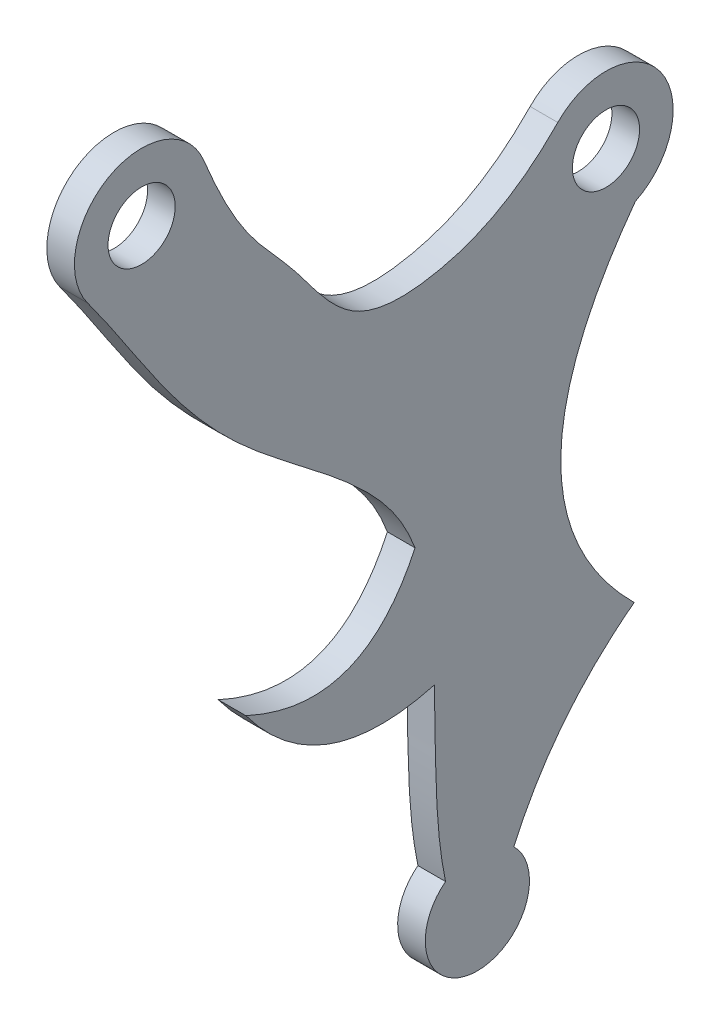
ISO-10303-21;
HEADER;
FILE_DESCRIPTION(('STEP AP214'),'2;1');
FILE_NAME('part.step','',(''),(''),'','','');
FILE_SCHEMA(('AUTOMOTIVE_DESIGN { 1 0 10303 214 1 1 1 1 }'));
ENDSEC;
DATA;
#1=APPLICATION_CONTEXT('core data for automotive mechanical design processes');
#2=APPLICATION_PROTOCOL_DEFINITION('international standard','automotive_design',2000,#1);
#3=PRODUCT_CONTEXT('',#1,'mechanical');
#4=PRODUCT('Part','Part','',(#3));
#5=PRODUCT_RELATED_PRODUCT_CATEGORY('part','',(#4));
#6=PRODUCT_DEFINITION_FORMATION('','',#4);
#7=PRODUCT_DEFINITION_CONTEXT('part definition',#1,'design');
#8=PRODUCT_DEFINITION('design','',#6,#7);
#9=PRODUCT_DEFINITION_SHAPE('','',#8);
#10=(LENGTH_UNIT() NAMED_UNIT(*) SI_UNIT(.MILLI.,.METRE.));
#11=(NAMED_UNIT(*) PLANE_ANGLE_UNIT() SI_UNIT($,.RADIAN.));
#12=(NAMED_UNIT(*) SI_UNIT($,.STERADIAN.) SOLID_ANGLE_UNIT());
#13=UNCERTAINTY_MEASURE_WITH_UNIT(LENGTH_MEASURE(1.E-05),#10,'distance_accuracy_value','');
#14=(GEOMETRIC_REPRESENTATION_CONTEXT(3) GLOBAL_UNCERTAINTY_ASSIGNED_CONTEXT((#13)) GLOBAL_UNIT_ASSIGNED_CONTEXT((#10,
#11,#12)) REPRESENTATION_CONTEXT('',''));
#15=CARTESIAN_POINT('',(0.,0.,0.));
#16=DIRECTION('',(0.,0.,1.));
#17=DIRECTION('',(1.,0.,0.));
#18=AXIS2_PLACEMENT_3D('',#15,#16,#17);
#19=CARTESIAN_POINT('',(7.37498578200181,-25.0102253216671,20.6861108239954));
#20=CARTESIAN_POINT('',(7.37498578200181,-29.779202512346,25.3133521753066));
#21=CARTESIAN_POINT('',(7.37498578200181,-33.2226011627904,33.226693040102));
#22=CARTESIAN_POINT('',(7.37498578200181,-33.059394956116,43.4810934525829));
#23=CARTESIAN_POINT('',(7.37498578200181,-20.8757063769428,51.4021485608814));
#24=CARTESIAN_POINT('',(7.37498578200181,-19.583144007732,54.91802754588));
#25=CARTESIAN_POINT('',(7.37498578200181,-9.35277054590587,59.1267170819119));
#26=B_SPLINE_CURVE_WITH_KNOTS('',3,(#19,#20,#21,#22,#23,#24,#25),.UNSPECIFIED.,.F.,.F.,(4,1,1,1,
4),(0.,0.244231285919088,0.417100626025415,0.60574582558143,1.),.UNSPECIFIED.);
#27=DIRECTION('',(1.,0.,0.));
#28=VECTOR('',#27,1.);
#29=SURFACE_OF_LINEAR_EXTRUSION('',#26,#28);
#30=DIRECTION('',(1.,0.,0.));
#31=VECTOR('',#30,1.);
#32=CARTESIAN_POINT('',(7.37498578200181,-25.0102253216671,20.6861108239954));
#33=LINE('',#32,#31);
#34=CARTESIAN_POINT('',(4.37498578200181,-25.0102253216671,20.6861108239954));
#35=VERTEX_POINT('',#34);
#36=CARTESIAN_POINT('',(7.37498578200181,-25.0102253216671,20.6861108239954));
#37=VERTEX_POINT('',#36);
#38=EDGE_CURVE('E11',#35,#37,#33,.T.);
#39=ORIENTED_EDGE('',*,*,#38,.F.);
#40=CARTESIAN_POINT('',(4.37498578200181,-25.0102253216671,20.6861108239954));
#41=CARTESIAN_POINT('',(4.37498578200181,-29.779202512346,25.3133521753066));
#42=CARTESIAN_POINT('',(4.37498578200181,-33.2226011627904,33.226693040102));
#43=CARTESIAN_POINT('',(4.37498578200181,-33.059394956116,43.4810934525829));
#44=CARTESIAN_POINT('',(4.37498578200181,-20.8757063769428,51.4021485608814));
#45=CARTESIAN_POINT('',(4.37498578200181,-19.583144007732,54.91802754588));
#46=CARTESIAN_POINT('',(4.37498578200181,-9.35277054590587,59.1267170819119));
#47=B_SPLINE_CURVE_WITH_KNOTS('',3,(#40,#41,#42,#43,#44,#45,#46),.UNSPECIFIED.,.F.,.F.,(4,1,1,1,
4),(0.,0.244231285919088,0.417100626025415,0.60574582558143,1.),.UNSPECIFIED.);
#48=CARTESIAN_POINT('',(4.37498578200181,-9.35277054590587,59.1267170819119));
#49=VERTEX_POINT('',#48);
#50=EDGE_CURVE('E216',#35,#49,#47,.T.);
#51=ORIENTED_EDGE('',*,*,#50,.T.);
#52=DIRECTION('',(1.,0.,0.));
#53=VECTOR('',#52,1.);
#54=CARTESIAN_POINT('',(7.37498578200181,-9.35277054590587,59.1267170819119));
#55=LINE('',#54,#53);
#56=CARTESIAN_POINT('',(7.37498578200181,-9.35277054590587,59.1267170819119));
#57=VERTEX_POINT('',#56);
#58=EDGE_CURVE('E51',#49,#57,#55,.T.);
#59=ORIENTED_EDGE('',*,*,#58,.T.);
#60=EDGE_CURVE('E183',#37,#57,#26,.T.);
#61=ORIENTED_EDGE('',*,*,#60,.F.);
#62=EDGE_LOOP('',(#39,#51,#59,#61));
#63=FACE_BOUND('',#62,.T.);
#64=ADVANCED_FACE('F42',(#63),#29,.T.);
#65=CARTESIAN_POINT('',(7.37498578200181,-12.1269197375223,65.8700470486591));
#66=DIRECTION('',(1.,0.,0.));
#67=DIRECTION('',(0.,0.,-1.));
#68=AXIS2_PLACEMENT_3D('',#65,#66,#67);
#69=CYLINDRICAL_SURFACE('',#68,7.29166666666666);
#70=ORIENTED_EDGE('',*,*,#58,.F.);
#71=CARTESIAN_POINT('',(4.37498578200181,-12.1269197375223,65.8700470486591));
#72=DIRECTION('',(1.,0.,0.));
#73=DIRECTION('',(0.,0.,-1.));
#74=AXIS2_PLACEMENT_3D('',#71,#72,#73);
#75=CIRCLE('',#74,7.29166666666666);
#76=CARTESIAN_POINT('',(4.37498578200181,-16.4526187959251,71.7400326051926));
#77=VERTEX_POINT('',#76);
#78=EDGE_CURVE('E219',#49,#77,#75,.T.);
#79=ORIENTED_EDGE('',*,*,#78,.T.);
#80=DIRECTION('',(1.,0.,0.));
#81=VECTOR('',#80,1.);
#82=CARTESIAN_POINT('',(7.37498578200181,-16.4526187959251,71.7400326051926));
#83=LINE('',#82,#81);
#84=CARTESIAN_POINT('',(7.37498578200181,-16.4526187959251,71.7400326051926));
#85=VERTEX_POINT('',#84);
#86=EDGE_CURVE('E207',#77,#85,#83,.T.);
#87=ORIENTED_EDGE('',*,*,#86,.T.);
#88=CARTESIAN_POINT('',(7.37498578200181,-12.1269197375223,65.8700470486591));
#89=DIRECTION('',(1.,0.,0.));
#90=DIRECTION('',(0.,0.,-1.));
#91=AXIS2_PLACEMENT_3D('',#88,#89,#90);
#92=CIRCLE('',#91,7.29166666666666);
#93=EDGE_CURVE('E190',#57,#85,#92,.T.);
#94=ORIENTED_EDGE('',*,*,#93,.F.);
#95=EDGE_LOOP('',(#70,#79,#87,#94));
#96=FACE_BOUND('',#95,.T.);
#97=ADVANCED_FACE('F174',(#96),#69,.T.);
#98=CARTESIAN_POINT('',(7.37498578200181,-16.4526187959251,71.7400326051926));
#99=CARTESIAN_POINT('',(7.37498578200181,-21.1908708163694,68.2483285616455));
#100=CARTESIAN_POINT('',(7.37498578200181,-29.0200369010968,63.6693040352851));
#101=CARTESIAN_POINT('',(7.37498578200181,-41.6337917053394,52.378888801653));
#102=CARTESIAN_POINT('',(7.37498578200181,-56.4648831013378,26.1681263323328));
#103=CARTESIAN_POINT('',(7.37498578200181,-87.4389157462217,38.3842110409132));
#104=CARTESIAN_POINT('',(7.37498578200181,-100.346883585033,28.4899302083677));
#105=B_SPLINE_CURVE_WITH_KNOTS('',3,(#98,#99,#100,#101,#102,#103,#104),.UNSPECIFIED.,.F.,.F.,(4,
1,1,1,4),(0.,0.172902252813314,0.282713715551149,0.516825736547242,1.),.UNSPECIFIED.);
#106=DIRECTION('',(1.,0.,0.));
#107=VECTOR('',#106,1.);
#108=SURFACE_OF_LINEAR_EXTRUSION('',#105,#107);
#109=ORIENTED_EDGE('',*,*,#86,.F.);
#110=CARTESIAN_POINT('',(4.37498578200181,-16.4526187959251,71.7400326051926));
#111=CARTESIAN_POINT('',(4.37498578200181,-21.1908708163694,68.2483285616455));
#112=CARTESIAN_POINT('',(4.37498578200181,-29.0200369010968,63.6693040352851));
#113=CARTESIAN_POINT('',(4.37498578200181,-41.6337917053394,52.378888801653));
#114=CARTESIAN_POINT('',(4.37498578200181,-56.4648831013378,26.1681263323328));
#115=CARTESIAN_POINT('',(4.37498578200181,-87.4389157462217,38.3842110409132));
#116=CARTESIAN_POINT('',(4.37498578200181,-100.346883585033,28.4899302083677));
#117=B_SPLINE_CURVE_WITH_KNOTS('',3,(#110,#111,#112,#113,#114,#115,#116),.UNSPECIFIED.,.F.,.F.,
(4,1,1,1,4),(0.,0.172902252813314,0.282713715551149,0.516825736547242,1.),.UNSPECIFIED.);
#118=CARTESIAN_POINT('',(4.37498578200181,-57.2539751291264,36.1864414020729));
#119=VERTEX_POINT('',#118);
#120=EDGE_CURVE('E209',#77,#119,#117,.T.);
#121=ORIENTED_EDGE('',*,*,#120,.T.);
#122=DIRECTION('',(1.,0.,0.));
#123=VECTOR('',#122,1.);
#124=CARTESIAN_POINT('',(7.37498578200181,-57.2539751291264,36.1864414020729));
#125=LINE('',#124,#123);
#126=CARTESIAN_POINT('',(7.37498578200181,-57.2539751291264,36.1864414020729));
#127=VERTEX_POINT('',#126);
#128=EDGE_CURVE('E134',#119,#127,#125,.T.);
#129=ORIENTED_EDGE('',*,*,#128,.T.);
#130=EDGE_CURVE('E145',#85,#127,#105,.T.);
#131=ORIENTED_EDGE('',*,*,#130,.F.);
#132=EDGE_LOOP('',(#109,#121,#129,#131));
#133=FACE_BOUND('',#132,.T.);
#134=ADVANCED_FACE('F173',(#133),#108,.T.);
#135=CARTESIAN_POINT('',(7.37498578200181,-63.8554620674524,54.5522225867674));
#136=CARTESIAN_POINT('',(7.37498578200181,-69.653599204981,41.9772947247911));
#137=CARTESIAN_POINT('',(7.37498578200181,-57.2539751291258,36.1864414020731));
#138=B_SPLINE_CURVE_WITH_KNOTS('',2,(#135,#136,#137),.UNSPECIFIED.,.F.,.F.,(3,3),(0.,1.),.UNSPECIFIED.);
#139=DIRECTION('',(1.,0.,0.));
#140=VECTOR('',#139,1.);
#141=SURFACE_OF_LINEAR_EXTRUSION('',#138,#140);
#142=ORIENTED_EDGE('',*,*,#128,.F.);
#143=CARTESIAN_POINT('',(4.37498578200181,-63.8554620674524,54.5522225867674));
#144=CARTESIAN_POINT('',(4.37498578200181,-69.653599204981,41.9772947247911));
#145=CARTESIAN_POINT('',(4.37498578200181,-57.2539751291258,36.1864414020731));
#146=B_SPLINE_CURVE_WITH_KNOTS('',2,(#143,#144,#145),.UNSPECIFIED.,.F.,.F.,(3,3),(0.,1.),.UNSPECIFIED.);
#147=CARTESIAN_POINT('',(4.37498578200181,-63.8554620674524,54.5522225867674));
#148=VERTEX_POINT('',#147);
#149=EDGE_CURVE('E129',#148,#119,#146,.T.);
#150=ORIENTED_EDGE('',*,*,#149,.F.);
#151=DIRECTION('',(1.,0.,0.));
#152=VECTOR('',#151,1.);
#153=CARTESIAN_POINT('',(7.37498578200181,-63.8554620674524,54.5522225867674));
#154=LINE('',#153,#152);
#155=CARTESIAN_POINT('',(7.37498578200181,-63.8554620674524,54.5522225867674));
#156=VERTEX_POINT('',#155);
#157=EDGE_CURVE('E124',#148,#156,#154,.T.);
#158=ORIENTED_EDGE('',*,*,#157,.T.);
#159=EDGE_CURVE('E127',#156,#127,#138,.T.);
#160=ORIENTED_EDGE('',*,*,#159,.T.);
#161=EDGE_LOOP('',(#142,#150,#158,#160));
#162=FACE_BOUND('',#161,.T.);
#163=ADVANCED_FACE('F126',(#162),#141,.F.);
#164=CARTESIAN_POINT('',(7.37498578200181,-71.1997140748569,34.0869295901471));
#165=CARTESIAN_POINT('',(7.37498578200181,-74.5968468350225,46.5739223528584));
#166=CARTESIAN_POINT('',(7.37498578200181,-63.8554620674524,54.5522225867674));
#167=B_SPLINE_CURVE_WITH_KNOTS('',2,(#164,#165,#166),.UNSPECIFIED.,.F.,.F.,(3,3),(0.,1.),.UNSPECIFIED.);
#168=DIRECTION('',(1.,0.,0.));
#169=VECTOR('',#168,1.);
#170=SURFACE_OF_LINEAR_EXTRUSION('',#167,#169);
#171=ORIENTED_EDGE('',*,*,#157,.F.);
#172=CARTESIAN_POINT('',(4.37498578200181,-71.1997140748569,34.0869295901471));
#173=CARTESIAN_POINT('',(4.37498578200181,-74.5968468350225,46.5739223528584));
#174=CARTESIAN_POINT('',(4.37498578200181,-63.8554620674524,54.5522225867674));
#175=B_SPLINE_CURVE_WITH_KNOTS('',2,(#172,#173,#174),.UNSPECIFIED.,.F.,.F.,(3,3),(0.,1.),.UNSPECIFIED.);
#176=CARTESIAN_POINT('',(4.37498578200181,-71.1997140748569,34.0869295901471));
#177=VERTEX_POINT('',#176);
#178=EDGE_CURVE('E279',#177,#148,#175,.T.);
#179=ORIENTED_EDGE('',*,*,#178,.F.);
#180=DIRECTION('',(1.,0.,0.));
#181=VECTOR('',#180,1.);
#182=CARTESIAN_POINT('',(7.37498578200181,-71.1997140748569,34.0869295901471));
#183=LINE('',#182,#181);
#184=CARTESIAN_POINT('',(7.37498578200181,-71.1997140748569,34.0869295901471));
#185=VERTEX_POINT('',#184);
#186=EDGE_CURVE('E135',#177,#185,#183,.T.);
#187=ORIENTED_EDGE('',*,*,#186,.T.);
#188=EDGE_CURVE('E141',#185,#156,#167,.T.);
#189=ORIENTED_EDGE('',*,*,#188,.T.);
#190=EDGE_LOOP('',(#171,#179,#187,#189));
#191=FACE_BOUND('',#190,.T.);
#192=ADVANCED_FACE('F147',(#191),#170,.F.);
#193=DIRECTION('',(1.,0.,0.));
#194=VECTOR('',#193,1.);
#195=CARTESIAN_POINT('',(7.37498578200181,-90.2904727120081,32.8721041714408));
#196=LINE('',#195,#194);
#197=CARTESIAN_POINT('',(7.37498578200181,-90.2904727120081,32.8721041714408));
#198=VERTEX_POINT('',#197);
#199=CARTESIAN_POINT('',(4.37498578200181,-90.2904727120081,32.8721041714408));
#200=VERTEX_POINT('',#199);
#201=EDGE_CURVE('E264',#198,#200,#196,.F.);
#202=ORIENTED_EDGE('',*,*,#201,.F.);
#203=EDGE_CURVE('E148',#185,#198,#105,.T.);
#204=ORIENTED_EDGE('',*,*,#203,.F.);
#205=ORIENTED_EDGE('',*,*,#186,.F.);
#206=CARTESIAN_POINT('',(4.37498578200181,-16.4526187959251,71.7400326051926));
#207=CARTESIAN_POINT('',(4.37498578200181,-21.1908708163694,68.2483285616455));
#208=CARTESIAN_POINT('',(4.37498578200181,-29.0200369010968,63.6693040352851));
#209=CARTESIAN_POINT('',(4.37498578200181,-41.6337917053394,52.378888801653));
#210=CARTESIAN_POINT('',(4.37498578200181,-56.4648831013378,26.1681263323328));
#211=CARTESIAN_POINT('',(4.37498578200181,-87.4389157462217,38.3842110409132));
#212=CARTESIAN_POINT('',(4.37498578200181,-100.346883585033,28.4899302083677));
#213=B_SPLINE_CURVE_WITH_KNOTS('',3,(#206,#207,#208,#209,#210,#211,#212),.UNSPECIFIED.,.F.,.F.,
(4,1,1,1,4),(0.,0.172902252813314,0.282713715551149,0.516825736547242,1.),.UNSPECIFIED.);
#214=EDGE_CURVE('E271',#177,#200,#213,.T.);
#215=ORIENTED_EDGE('',*,*,#214,.T.);
#216=EDGE_LOOP('',(#202,#204,#205,#215));
#217=FACE_BOUND('',#216,.T.);
#218=ADVANCED_FACE('F169',(#217),#108,.T.);
#219=CARTESIAN_POINT('',(7.37498578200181,-100.346883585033,28.4899302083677));
#220=CARTESIAN_POINT('',(7.37498578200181,-83.9088981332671,25.0862169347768));
#221=CARTESIAN_POINT('',(7.37498578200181,-74.2909084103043,12.3938322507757));
#222=B_SPLINE_CURVE_WITH_KNOTS('',2,(#219,#220,#221),.UNSPECIFIED.,.F.,.F.,(3,3),(0.,1.),.UNSPECIFIED.);
#223=DIRECTION('',(1.,0.,0.));
#224=VECTOR('',#223,1.);
#225=SURFACE_OF_LINEAR_EXTRUSION('',#222,#224);
#226=DIRECTION('',(1.,0.,0.));
#227=VECTOR('',#226,1.);
#228=CARTESIAN_POINT('',(7.37498578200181,-90.7325032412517,25.4525785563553));
#229=LINE('',#228,#227);
#230=CARTESIAN_POINT('',(4.37498578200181,-90.7325032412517,25.4525785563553));
#231=VERTEX_POINT('',#230);
#232=CARTESIAN_POINT('',(7.37498578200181,-90.7325032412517,25.4525785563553));
#233=VERTEX_POINT('',#232);
#234=EDGE_CURVE('E298',#231,#233,#229,.T.);
#235=ORIENTED_EDGE('',*,*,#234,.F.);
#236=CARTESIAN_POINT('',(4.37498578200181,-100.346883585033,28.4899302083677));
#237=CARTESIAN_POINT('',(4.37498578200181,-83.9088981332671,25.0862169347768));
#238=CARTESIAN_POINT('',(4.37498578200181,-74.2909084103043,12.3938322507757));
#239=B_SPLINE_CURVE_WITH_KNOTS('',2,(#236,#237,#238),.UNSPECIFIED.,.F.,.F.,(3,3),(0.,1.),.UNSPECIFIED.);
#240=CARTESIAN_POINT('',(4.37498578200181,-74.2909084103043,12.3938322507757));
#241=VERTEX_POINT('',#240);
#242=EDGE_CURVE('E243',#231,#241,#239,.T.);
#243=ORIENTED_EDGE('',*,*,#242,.T.);
#244=DIRECTION('',(1.,0.,0.));
#245=VECTOR('',#244,1.);
#246=CARTESIAN_POINT('',(7.37498578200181,-74.2909084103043,12.3938322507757));
#247=LINE('',#246,#245);
#248=CARTESIAN_POINT('',(7.37498578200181,-74.2909084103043,12.3938322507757));
#249=VERTEX_POINT('',#248);
#250=EDGE_CURVE('E247',#241,#249,#247,.T.);
#251=ORIENTED_EDGE('',*,*,#250,.T.);
#252=EDGE_CURVE('E64',#233,#249,#222,.T.);
#253=ORIENTED_EDGE('',*,*,#252,.F.);
#254=EDGE_LOOP('',(#235,#243,#251,#253));
#255=FACE_BOUND('',#254,.T.);
#256=ADVANCED_FACE('F312',(#255),#225,.T.);
#257=CARTESIAN_POINT('',(7.37498578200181,-74.2909084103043,12.3938322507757));
#258=CARTESIAN_POINT('',(7.37498578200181,-58.4363439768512,28.3906640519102));
#259=CARTESIAN_POINT('',(7.37498578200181,-36.64763410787,12.2689587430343));
#260=B_SPLINE_CURVE_WITH_KNOTS('',2,(#257,#258,#259),.UNSPECIFIED.,.F.,.F.,(3,3),(0.,1.),.UNSPECIFIED.);
#261=DIRECTION('',(1.,0.,0.));
#262=VECTOR('',#261,1.);
#263=SURFACE_OF_LINEAR_EXTRUSION('',#260,#262);
#264=ORIENTED_EDGE('',*,*,#250,.F.);
#265=CARTESIAN_POINT('',(4.37498578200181,-74.2909084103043,12.3938322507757));
#266=CARTESIAN_POINT('',(4.37498578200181,-58.4363439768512,28.3906640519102));
#267=CARTESIAN_POINT('',(4.37498578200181,-36.64763410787,12.2689587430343));
#268=B_SPLINE_CURVE_WITH_KNOTS('',2,(#265,#266,#267),.UNSPECIFIED.,.F.,.F.,(3,3),(0.,1.),.UNSPECIFIED.);
#269=CARTESIAN_POINT('',(4.37498578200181,-36.64763410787,12.2689587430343));
#270=VERTEX_POINT('',#269);
#271=EDGE_CURVE('E238',#241,#270,#268,.T.);
#272=ORIENTED_EDGE('',*,*,#271,.T.);
#273=DIRECTION('',(1.,0.,0.));
#274=VECTOR('',#273,1.);
#275=CARTESIAN_POINT('',(7.37498578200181,-36.64763410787,12.2689587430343));
#276=LINE('',#275,#274);
#277=CARTESIAN_POINT('',(7.37498578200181,-36.64763410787,12.2689587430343));
#278=VERTEX_POINT('',#277);
#279=EDGE_CURVE('E46',#270,#278,#276,.T.);
#280=ORIENTED_EDGE('',*,*,#279,.T.);
#281=EDGE_CURVE('E246',#249,#278,#260,.T.);
#282=ORIENTED_EDGE('',*,*,#281,.F.);
#283=EDGE_LOOP('',(#264,#272,#280,#282));
#284=FACE_BOUND('',#283,.T.);
#285=ADVANCED_FACE('F309',(#284),#263,.T.);
#286=CARTESIAN_POINT('',(7.37498578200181,-30.0878599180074,15.4529445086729));
#287=DIRECTION('',(1.,0.,0.));
#288=DIRECTION('',(0.,0.,-1.));
#289=AXIS2_PLACEMENT_3D('',#286,#287,#288);
#290=CYLINDRICAL_SURFACE('',#289,7.29166666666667);
#291=CARTESIAN_POINT('',(4.37498578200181,-30.0878599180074,15.4529445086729));
#292=DIRECTION('',(1.,0.,0.));
#293=DIRECTION('',(0.,0.,-1.));
#294=AXIS2_PLACEMENT_3D('',#291,#292,#293);
#295=CIRCLE('',#294,7.29166666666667);
#296=EDGE_CURVE('E226',#270,#35,#295,.T.);
#297=ORIENTED_EDGE('',*,*,#296,.T.);
#298=ORIENTED_EDGE('',*,*,#38,.T.);
#299=CARTESIAN_POINT('',(7.37498578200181,-30.0878599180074,15.4529445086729));
#300=DIRECTION('',(1.,0.,0.));
#301=DIRECTION('',(0.,0.,-1.));
#302=AXIS2_PLACEMENT_3D('',#299,#300,#301);
#303=CIRCLE('',#302,7.29166666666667);
#304=EDGE_CURVE('E191',#278,#37,#303,.T.);
#305=ORIENTED_EDGE('',*,*,#304,.F.);
#306=ORIENTED_EDGE('',*,*,#279,.F.);
#307=EDGE_LOOP('',(#297,#298,#305,#306));
#308=FACE_BOUND('',#307,.T.);
#309=ADVANCED_FACE('F182',(#308),#290,.T.);
#310=CARTESIAN_POINT('',(7.37498578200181,-12.1269197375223,65.8700470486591));
#311=DIRECTION('',(1.,0.,0.));
#312=DIRECTION('',(0.,0.,-1.));
#313=AXIS2_PLACEMENT_3D('',#310,#311,#312);
#314=CYLINDRICAL_SURFACE('',#313,3.64583333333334);
#315=CARTESIAN_POINT('',(7.37498578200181,-12.1269197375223,65.8700470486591));
#316=DIRECTION('',(1.,0.,0.));
#317=DIRECTION('',(0.,0.,-1.));
#318=AXIS2_PLACEMENT_3D('',#315,#316,#317);
#319=CIRCLE('',#318,3.64583333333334);
#320=CARTESIAN_POINT('',(7.37498578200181,-12.1269197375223,62.2242137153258));
#321=VERTEX_POINT('',#320);
#322=EDGE_CURVE('E255',#321,#321,#319,.T.);
#323=ORIENTED_EDGE('',*,*,#322,.T.);
#324=EDGE_LOOP('',(#323));
#325=FACE_BOUND('',#324,.T.);
#326=CARTESIAN_POINT('',(4.37498578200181,-12.1269197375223,65.8700470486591));
#327=DIRECTION('',(1.,0.,0.));
#328=DIRECTION('',(0.,0.,-1.));
#329=AXIS2_PLACEMENT_3D('',#326,#327,#328);
#330=CIRCLE('',#329,3.64583333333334);
#331=CARTESIAN_POINT('',(4.37498578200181,-12.1269197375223,62.2242137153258));
#332=VERTEX_POINT('',#331);
#333=EDGE_CURVE('E239',#332,#332,#330,.T.);
#334=ORIENTED_EDGE('',*,*,#333,.F.);
#335=EDGE_LOOP('',(#334));
#336=FACE_BOUND('',#335,.T.);
#337=ADVANCED_FACE('F321',(#325,#336),#314,.F.);
#338=CARTESIAN_POINT('',(7.37498578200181,-30.0878599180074,15.4529445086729));
#339=DIRECTION('',(1.,0.,0.));
#340=DIRECTION('',(0.,0.,-1.));
#341=AXIS2_PLACEMENT_3D('',#338,#339,#340);
#342=CYLINDRICAL_SURFACE('',#341,3.64583333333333);
#343=CARTESIAN_POINT('',(7.37498578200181,-30.0878599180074,15.4529445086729));
#344=DIRECTION('',(1.,0.,0.));
#345=DIRECTION('',(0.,0.,-1.));
#346=AXIS2_PLACEMENT_3D('',#343,#344,#345);
#347=CIRCLE('',#346,3.64583333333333);
#348=CARTESIAN_POINT('',(7.37498578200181,-30.0878599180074,11.8071111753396));
#349=VERTEX_POINT('',#348);
#350=EDGE_CURVE('E251',#349,#349,#347,.T.);
#351=ORIENTED_EDGE('',*,*,#350,.T.);
#352=EDGE_LOOP('',(#351));
#353=FACE_BOUND('',#352,.T.);
#354=CARTESIAN_POINT('',(4.37498578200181,-30.0878599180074,15.4529445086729));
#355=DIRECTION('',(1.,0.,0.));
#356=DIRECTION('',(0.,0.,-1.));
#357=AXIS2_PLACEMENT_3D('',#354,#355,#356);
#358=CIRCLE('',#357,3.64583333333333);
#359=CARTESIAN_POINT('',(4.37498578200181,-30.0878599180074,11.8071111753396));
#360=VERTEX_POINT('',#359);
#361=EDGE_CURVE('E242',#360,#360,#358,.T.);
#362=ORIENTED_EDGE('',*,*,#361,.F.);
#363=EDGE_LOOP('',(#362));
#364=FACE_BOUND('',#363,.T.);
#365=ADVANCED_FACE('F44',(#353,#364),#342,.F.);
#366=CARTESIAN_POINT('',(7.37498578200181,22.1863715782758,-16.4663312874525));
#367=DIRECTION('',(1.,0.,0.));
#368=DIRECTION('',(0.,0.,-1.));
#369=AXIS2_PLACEMENT_3D('',#366,#367,#368);
#370=PLANE('',#369);
#371=ORIENTED_EDGE('',*,*,#203,.T.);
#372=CARTESIAN_POINT('',(7.37498578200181,-94.7673889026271,29.4158937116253));
#373=DIRECTION('',(1.,0.,0.));
#374=DIRECTION('',(0.,0.,-1.));
#375=AXIS2_PLACEMENT_3D('',#372,#373,#374);
#376=CIRCLE('',#375,5.65580845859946);
#377=EDGE_CURVE('E58',#198,#233,#376,.T.);
#378=ORIENTED_EDGE('',*,*,#377,.T.);
#379=ORIENTED_EDGE('',*,*,#252,.T.);
#380=ORIENTED_EDGE('',*,*,#281,.T.);
#381=ORIENTED_EDGE('',*,*,#304,.T.);
#382=ORIENTED_EDGE('',*,*,#60,.T.);
#383=ORIENTED_EDGE('',*,*,#93,.T.);
#384=ORIENTED_EDGE('',*,*,#130,.T.);
#385=ORIENTED_EDGE('',*,*,#159,.F.);
#386=ORIENTED_EDGE('',*,*,#188,.F.);
#387=EDGE_LOOP('',(#371,#378,#379,#380,#381,#382,#383,#384,#385,#386));
#388=FACE_BOUND('',#387,.T.);
#389=ORIENTED_EDGE('',*,*,#322,.F.);
#390=EDGE_LOOP('',(#389));
#391=FACE_BOUND('',#390,.T.);
#392=ORIENTED_EDGE('',*,*,#350,.F.);
#393=EDGE_LOOP('',(#392));
#394=FACE_BOUND('',#393,.T.);
#395=ADVANCED_FACE('F139',(#388,#391,#394),#370,.T.);
#396=CARTESIAN_POINT('',(4.37498578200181,22.1863715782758,-16.4663312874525));
#397=DIRECTION('',(1.,0.,0.));
#398=DIRECTION('',(0.,0.,-1.));
#399=AXIS2_PLACEMENT_3D('',#396,#397,#398);
#400=PLANE('',#399);
#401=ORIENTED_EDGE('',*,*,#242,.F.);
#402=CARTESIAN_POINT('',(4.37498578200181,-94.7673889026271,29.4158937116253));
#403=DIRECTION('',(1.,0.,0.));
#404=DIRECTION('',(0.,0.,-1.));
#405=AXIS2_PLACEMENT_3D('',#402,#403,#404);
#406=CIRCLE('',#405,5.65580845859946);
#407=EDGE_CURVE('E296',#200,#231,#406,.T.);
#408=ORIENTED_EDGE('',*,*,#407,.F.);
#409=ORIENTED_EDGE('',*,*,#214,.F.);
#410=ORIENTED_EDGE('',*,*,#178,.T.);
#411=ORIENTED_EDGE('',*,*,#149,.T.);
#412=ORIENTED_EDGE('',*,*,#120,.F.);
#413=ORIENTED_EDGE('',*,*,#78,.F.);
#414=ORIENTED_EDGE('',*,*,#50,.F.);
#415=ORIENTED_EDGE('',*,*,#296,.F.);
#416=ORIENTED_EDGE('',*,*,#271,.F.);
#417=EDGE_LOOP('',(#401,#408,#409,#410,#411,#412,#413,#414,#415,#416));
#418=FACE_BOUND('',#417,.T.);
#419=ORIENTED_EDGE('',*,*,#333,.T.);
#420=EDGE_LOOP('',(#419));
#421=FACE_BOUND('',#420,.T.);
#422=ORIENTED_EDGE('',*,*,#361,.T.);
#423=EDGE_LOOP('',(#422));
#424=FACE_BOUND('',#423,.T.);
#425=ADVANCED_FACE('F222',(#418,#421,#424),#400,.F.);
#426=CARTESIAN_POINT('',(4.37498578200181,-94.7673889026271,29.4158937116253));
#427=DIRECTION('',(1.,0.,0.));
#428=DIRECTION('',(0.,0.,-1.));
#429=AXIS2_PLACEMENT_3D('',#426,#427,#428);
#430=CYLINDRICAL_SURFACE('',#429,5.65580845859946);
#431=ORIENTED_EDGE('',*,*,#377,.F.);
#432=ORIENTED_EDGE('',*,*,#201,.T.);
#433=ORIENTED_EDGE('',*,*,#407,.T.);
#434=ORIENTED_EDGE('',*,*,#234,.T.);
#435=EDGE_LOOP('',(#431,#432,#433,#434));
#436=FACE_BOUND('',#435,.T.);
#437=ADVANCED_FACE('F334',(#436),#430,.T.);
#438=CLOSED_SHELL('',(#64,#97,#134,#163,#192,#218,#256,#285,#309,#337,#365,#395,#425,#437));
#439=MANIFOLD_SOLID_BREP('B2',#438);
#440=ADVANCED_BREP_SHAPE_REPRESENTATION('',(#18,#439),#14);
#441=SHAPE_DEFINITION_REPRESENTATION(#9,#440);
ENDSEC;
END-ISO-10303-21;
